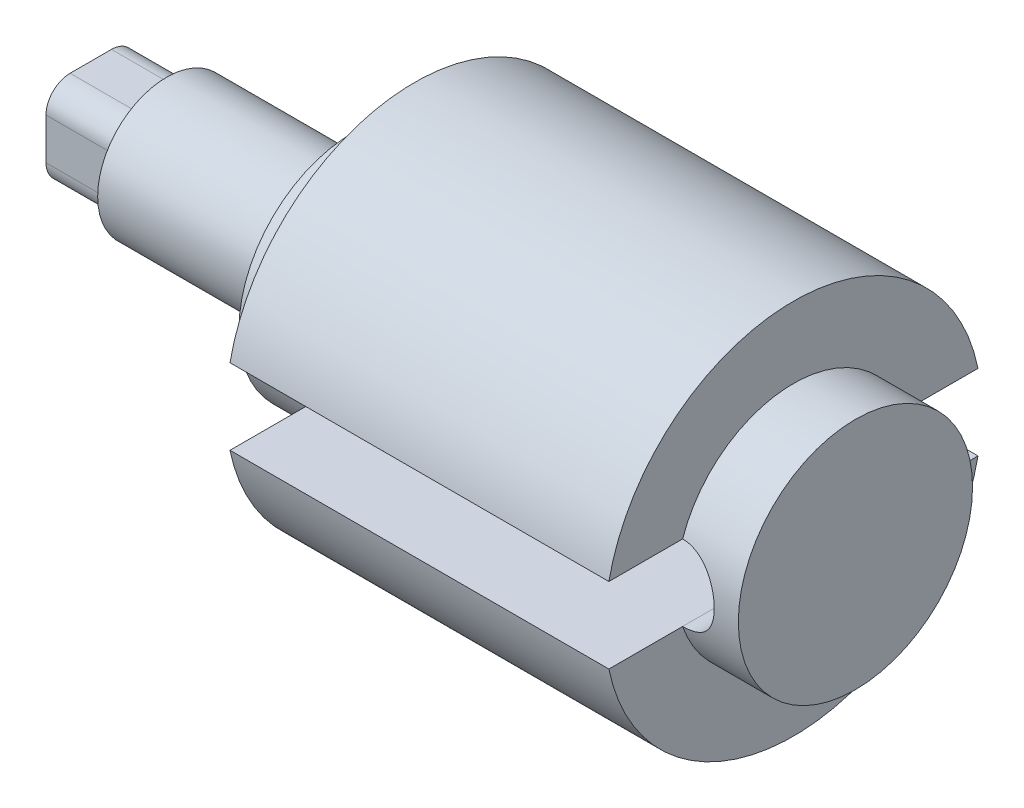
from build123d import *

# Parameters (mm, degrees)
ENL_V_MAT_EXTRU_1_DEPTH      = 118.545927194
ENL_V_MAT_EXTRU_1_DEPTH_BACK = 118.545927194
ESQUISSE3_OUTSIDE_W          = 82.552
ESQUISSE3_OUTSIDE_H          = 83.67
ENL_V_MAT_EXTRU_2_DEPTH      = 11
TROU_TARAUD_M61_D            = 5
TROU_TARAUD_M61_DEPTH        = 17
TROU_TARAUD_M61_TIP          = 1.502151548


with BuildPart() as part:
    # Esquisse1 → R_volution1 (revolve)
    with BuildSketch(Plane.XY, mode=Mode.PRIVATE) as r_volution1_sk:
        Polygon((0, 0), (0, 10), (38, 10), (38, 16.5), (47, 16.5), (47, 27.35), (102, 27.35), (102, 17), (111, 17), (111, 0), align=None)
    revolve(r_volution1_sk.sketch.rotate(Axis((0, 0, 0), (1, 0, 0)), 90), axis=Axis((0, 0, 0), (1, 0, 0)))

    # Esquisse2 → Enl_v. mat.-Extru.1 (cut, two sides: drawn at the far end of the back side and taken through both)
    with BuildSketch(Plane.XY.offset(-ENL_V_MAT_EXTRU_1_DEPTH_BACK)):
        with BuildLine():
            Line((47, 5.5), (102, 5.5))
            ThreePointArc((102, 5.5), (107.5, 0), (102, -5.5))
            Line((102, -5.5), (47, -5.5))
            ThreePointArc((47, -5.5), (41.5, 0), (47, 5.5))
        make_face()
    extrude(amount=ENL_V_MAT_EXTRU_1_DEPTH + ENL_V_MAT_EXTRU_1_DEPTH_BACK, mode=Mode.SUBTRACT)

    # Esquisse3 outside → Enl_v. mat.-Extru.2 (cut)
    with BuildSketch(Plane.ZY):
        Rectangle(ESQUISSE3_OUTSIDE_W, ESQUISSE3_OUTSIDE_H)
        with BuildLine():
            Line((-3, 6.5), (3, 6.5))
            ThreePointArc((3, 6.5), (5.474873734, 5.474873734), (6.5, 3))
            Line((6.5, 3), (6.5, -3))
            ThreePointArc((6.5, -3), (5.474873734, -5.474873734), (3, -6.5))
            Line((3, -6.5), (-3, -6.5))
            ThreePointArc((-3, -6.5), (-5.474873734, -5.474873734), (-6.5, -3))
            Line((-6.5, -3), (-6.5, 3))
            ThreePointArc((-6.5, 3), (-5.474873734, 5.474873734), (-3, 6.5))
        make_face(mode=Mode.SUBTRACT)
    extrude(amount=-ENL_V_MAT_EXTRU_2_DEPTH, mode=Mode.SUBTRACT)

    # Trou taraud_ M61
    with Locations(Plane.ZY):
        with Locations((0, 0)):
            Hole(TROU_TARAUD_M61_D / 2, depth=TROU_TARAUD_M61_DEPTH)
            with Locations((0, 0, -(TROU_TARAUD_M61_DEPTH + TROU_TARAUD_M61_TIP / 2))):  # 118° drill point
                Cone(0, TROU_TARAUD_M61_D / 2, TROU_TARAUD_M61_TIP, mode=Mode.SUBTRACT)


solid = part.part
